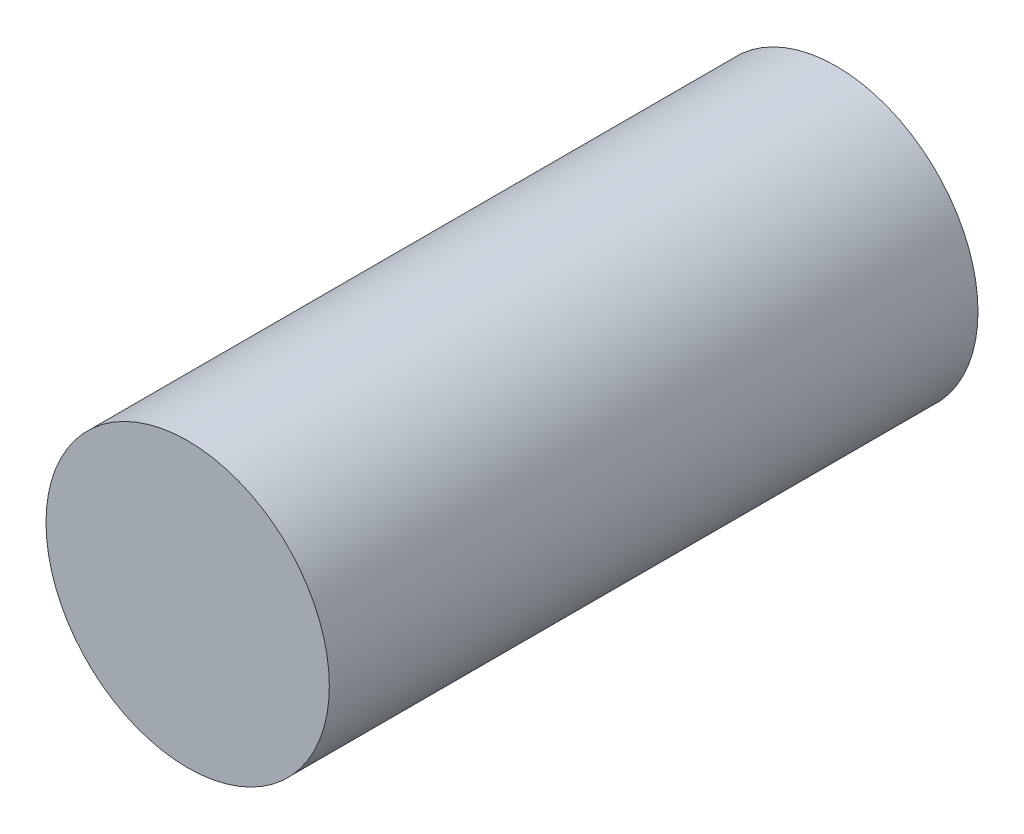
from build123d import *

# Parameters (mm, degrees)
SKETCH1_R               = 0.360554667
COMPONENT_OUTLINE_DEPTH = 1.651


with BuildPart() as part:
    # Sketch1 → Component_Outline (new body)
    with BuildSketch(Plane.XY):
        with Locations((-4, 4)):
            Circle(SKETCH1_R)
    extrude(amount=COMPONENT_OUTLINE_DEPTH)


solid = part.part
